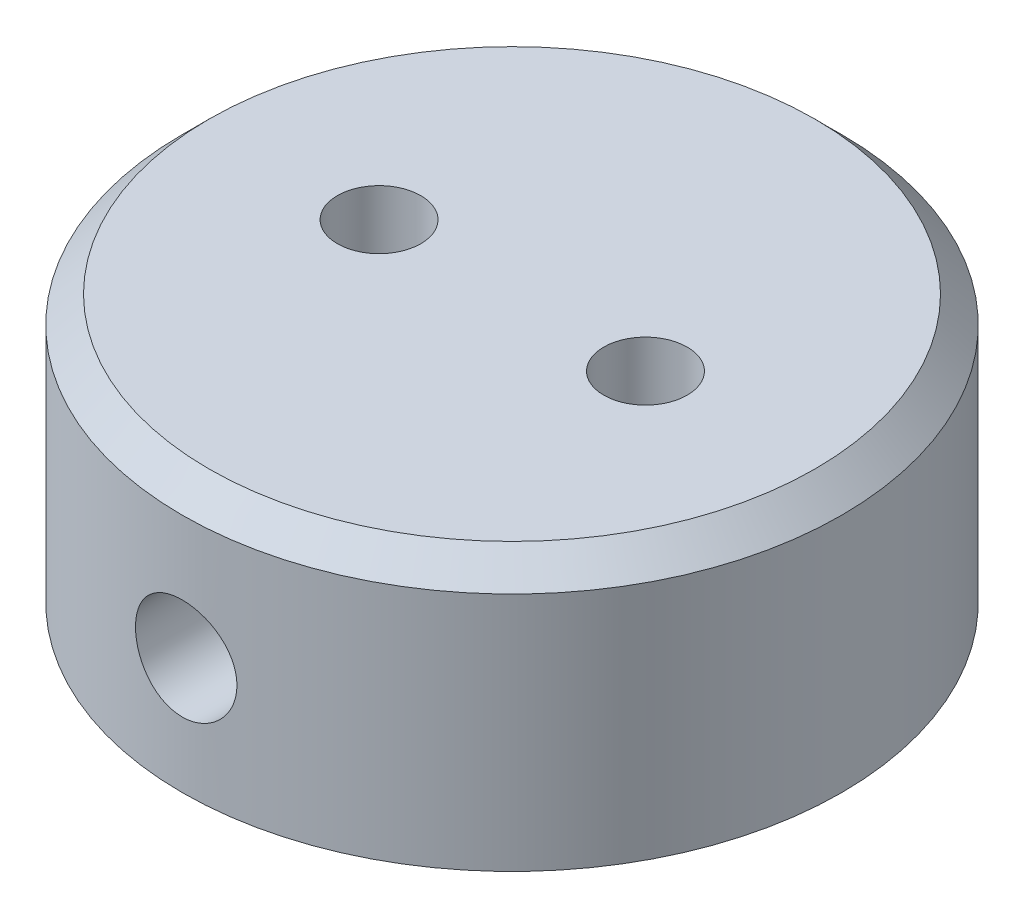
from build123d import *

# Parameters (mm, degrees)
SKETCH1_R                   = 31.369
EXTRUDE1_DEPTH              = 25.4
CHAMFER1_SIZE               = 2.54
CUT_EXTRUDE1_DEPTH          = 52.119353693
CUT_EXTRUDE1_DEPTH_BACK     = 52.119353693
SKETCH10_R                  = 4.826
F_3_8_16_TAPPED_HOLE1_D     = 7.9375
F_3_8_16_TAPPED_HOLE1_DEPTH = 26.9875
F_3_8_16_TAPPED_HOLE1_TIP   = 2.384665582


with BuildPart() as part:
    # Sketch1 → Extrude1 (new body)
    with BuildSketch(Plane(origin=(0, 0, 0), x_dir=(1, 0, 0), z_dir=(0, 1, 0))):
        with Locations(Location((0, 0, 0), (0, 0, 270))):
            Circle(SKETCH1_R)
    extrude(amount=EXTRUDE1_DEPTH)

    # Chamfer1
    chamfer1_edges = [part.edges().sort_by_distance(p)[0] for p in [
        (0, 25.4, -31.369),
    ]]
    chamfer(chamfer1_edges, length=CHAMFER1_SIZE)

    # Sketch10 → Cut-Extrude1 (cut, two sides: drawn at the far end of the back side and taken through both)
    with BuildSketch(Plane.XY.offset(-CUT_EXTRUDE1_DEPTH_BACK)):
        with Locations((0, 11.056873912)):
            Circle(SKETCH10_R)
    extrude(amount=CUT_EXTRUDE1_DEPTH + CUT_EXTRUDE1_DEPTH_BACK, mode=Mode.SUBTRACT)

    # 3_8-16 Tapped Hole1
    with Locations(Plane(origin=(-12.452762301, 0, 0.194451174), x_dir=(0, 0, -1), z_dir=(0, -1, 0))):
        with Locations((0, 0), (0.194451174, 25.152762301)):
            Hole(F_3_8_16_TAPPED_HOLE1_D / 2, depth=F_3_8_16_TAPPED_HOLE1_DEPTH)
            with Locations((0, 0, -(F_3_8_16_TAPPED_HOLE1_DEPTH + F_3_8_16_TAPPED_HOLE1_TIP / 2))):  # 118° drill point
                Cone(0, F_3_8_16_TAPPED_HOLE1_D / 2, F_3_8_16_TAPPED_HOLE1_TIP, mode=Mode.SUBTRACT)


solid = part.part
